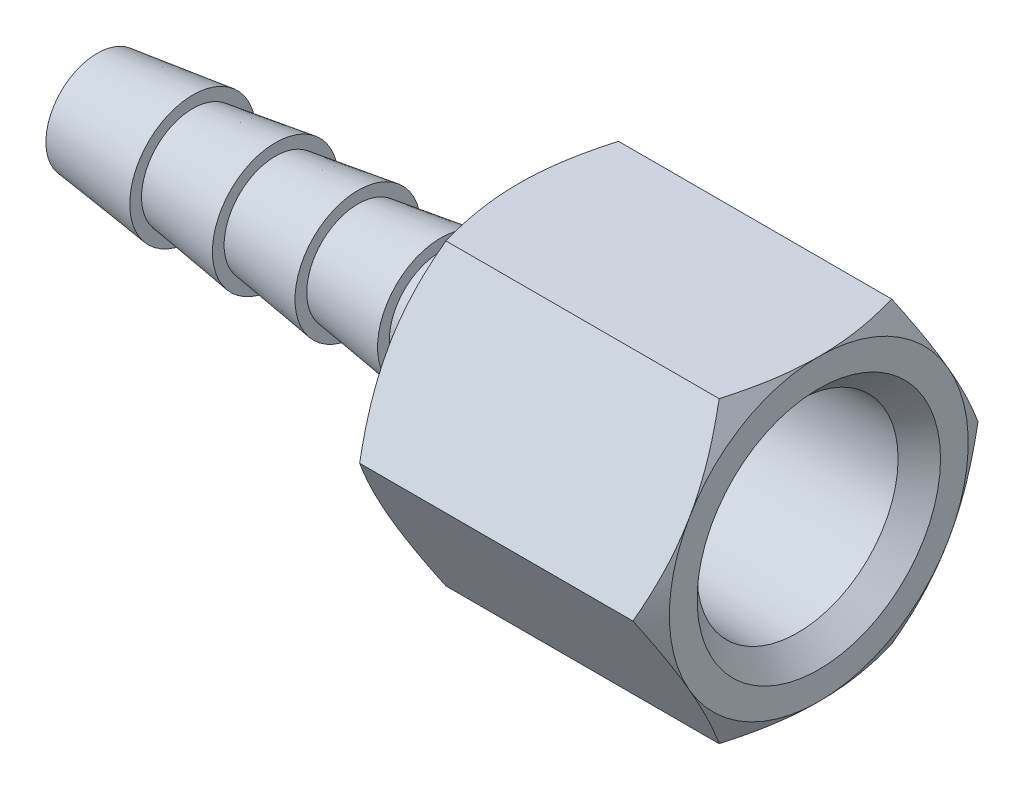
ISO-10303-21;
HEADER;
FILE_DESCRIPTION(('STEP AP214'),'2;1');
FILE_NAME('part.step','',(''),(''),'','','');
FILE_SCHEMA(('AUTOMOTIVE_DESIGN { 1 0 10303 214 1 1 1 1 }'));
ENDSEC;
DATA;
#1=APPLICATION_CONTEXT('core data for automotive mechanical design processes');
#2=APPLICATION_PROTOCOL_DEFINITION('international standard','automotive_design',2000,#1);
#3=PRODUCT_CONTEXT('',#1,'mechanical');
#4=PRODUCT('Part','Part','',(#3));
#5=PRODUCT_RELATED_PRODUCT_CATEGORY('part','',(#4));
#6=PRODUCT_DEFINITION_FORMATION('','',#4);
#7=PRODUCT_DEFINITION_CONTEXT('part definition',#1,'design');
#8=PRODUCT_DEFINITION('design','',#6,#7);
#9=PRODUCT_DEFINITION_SHAPE('','',#8);
#10=(LENGTH_UNIT() NAMED_UNIT(*) SI_UNIT(.MILLI.,.METRE.));
#11=(NAMED_UNIT(*) PLANE_ANGLE_UNIT() SI_UNIT($,.RADIAN.));
#12=(NAMED_UNIT(*) SI_UNIT($,.STERADIAN.) SOLID_ANGLE_UNIT());
#13=UNCERTAINTY_MEASURE_WITH_UNIT(LENGTH_MEASURE(1.E-05),#10,'distance_accuracy_value','');
#14=(GEOMETRIC_REPRESENTATION_CONTEXT(3) GLOBAL_UNCERTAINTY_ASSIGNED_CONTEXT((#13)) GLOBAL_UNIT_ASSIGNED_CONTEXT((#10,
#11,#12)) REPRESENTATION_CONTEXT('',''));
#15=CARTESIAN_POINT('',(0.,0.,0.));
#16=DIRECTION('',(0.,0.,1.));
#17=DIRECTION('',(1.,0.,0.));
#18=AXIS2_PLACEMENT_3D('',#15,#16,#17);
#19=CARTESIAN_POINT('',(0.,0.,1.4986));
#20=DIRECTION('',(-1.,0.,0.));
#21=DIRECTION('',(0.,0.,1.));
#22=AXIS2_PLACEMENT_3D('',#19,#20,#21);
#23=PLANE('',#22);
#24=CARTESIAN_POINT('',(0.,0.,0.));
#25=DIRECTION('',(1.,0.,0.));
#26=DIRECTION('',(0.,0.,-1.));
#27=AXIS2_PLACEMENT_3D('',#24,#25,#26);
#28=CIRCLE('',#27,2.3749);
#29=CARTESIAN_POINT('',(0.,0.,-2.3749));
#30=VERTEX_POINT('',#29);
#31=EDGE_CURVE('E20',#30,#30,#28,.T.);
#32=ORIENTED_EDGE('',*,*,#31,.T.);
#33=EDGE_LOOP('',(#32));
#34=FACE_BOUND('',#33,.T.);
#35=CARTESIAN_POINT('',(-5.6843418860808E-11,0.,0.));
#36=DIRECTION('',(1.,0.,0.));
#37=DIRECTION('',(0.,0.,-1.));
#38=AXIS2_PLACEMENT_3D('',#35,#36,#37);
#39=CIRCLE('',#38,2.99720000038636);
#40=CARTESIAN_POINT('',(-5.6843418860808E-11,0.,-2.99720000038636));
#41=VERTEX_POINT('',#40);
#42=EDGE_CURVE('E369',#41,#41,#39,.T.);
#43=ORIENTED_EDGE('',*,*,#42,.F.);
#44=EDGE_LOOP('',(#43));
#45=FACE_BOUND('',#44,.T.);
#46=ADVANCED_FACE('F16',(#34,#45),#23,.T.);
#47=CARTESIAN_POINT('',(0.,0.,0.));
#48=DIRECTION('',(1.,0.,0.));
#49=DIRECTION('',(0.,0.,-1.));
#50=AXIS2_PLACEMENT_3D('',#47,#48,#49);
#51=CYLINDRICAL_SURFACE('',#50,2.3749);
#52=ORIENTED_EDGE('',*,*,#31,.F.);
#53=EDGE_LOOP('',(#52));
#54=FACE_BOUND('',#53,.T.);
#55=CARTESIAN_POINT('',(26.002506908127,0.,0.));
#56=DIRECTION('',(1.,0.,0.));
#57=DIRECTION('',(0.,1.,0.));
#58=AXIS2_PLACEMENT_3D('',#55,#56,#57);
#59=CIRCLE('',#58,2.3749);
#60=CARTESIAN_POINT('',(26.0025069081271,2.37489999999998,0.));
#61=VERTEX_POINT('',#60);
#62=EDGE_CURVE('E365',#61,#61,#59,.T.);
#63=ORIENTED_EDGE('',*,*,#62,.T.);
#64=EDGE_LOOP('',(#63));
#65=FACE_BOUND('',#64,.T.);
#66=ADVANCED_FACE('F448',(#54,#65),#51,.F.);
#67=CARTESIAN_POINT('',(5.58799999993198,0.,0.));
#68=DIRECTION('',(1.,0.,0.));
#69=DIRECTION('',(0.,0.,-1.));
#70=AXIS2_PLACEMENT_3D('',#67,#68,#69);
#71=CONICAL_SURFACE('',#70,3.68299999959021,0.122116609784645);
#72=ORIENTED_EDGE('',*,*,#42,.T.);
#73=EDGE_LOOP('',(#72));
#74=FACE_BOUND('',#73,.T.);
#75=CARTESIAN_POINT('',(5.58800000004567,0.,0.));
#76=DIRECTION('',(1.,0.,0.));
#77=DIRECTION('',(0.,0.,-1.));
#78=AXIS2_PLACEMENT_3D('',#75,#76,#77);
#79=CIRCLE('',#78,3.68299999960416);
#80=CARTESIAN_POINT('',(5.58800000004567,0.,-3.68299999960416));
#81=VERTEX_POINT('',#80);
#82=EDGE_CURVE('E368',#81,#81,#79,.T.);
#83=ORIENTED_EDGE('',*,*,#82,.F.);
#84=EDGE_LOOP('',(#83));
#85=FACE_BOUND('',#84,.T.);
#86=ADVANCED_FACE('F445',(#74,#85),#71,.T.);
#87=CARTESIAN_POINT('',(27.94,0.,0.));
#88=DIRECTION('',(1.,0.,0.));
#89=DIRECTION('',(0.,1.,0.));
#90=AXIS2_PLACEMENT_3D('',#87,#88,#89);
#91=CONICAL_SURFACE('',#90,5.59943,1.02974425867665);
#92=CARTESIAN_POINT('',(27.94,0.,0.));
#93=DIRECTION('',(1.,0.,0.));
#94=DIRECTION('',(0.,0.,-1.));
#95=AXIS2_PLACEMENT_3D('',#92,#93,#94);
#96=CIRCLE('',#95,5.59943);
#97=CARTESIAN_POINT('',(27.94,0.,-5.59943000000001));
#98=VERTEX_POINT('',#97);
#99=EDGE_CURVE('E370',#98,#98,#96,.T.);
#100=ORIENTED_EDGE('',*,*,#99,.T.);
#101=EDGE_LOOP('',(#100));
#102=FACE_BOUND('',#101,.T.);
#103=ORIENTED_EDGE('',*,*,#62,.F.);
#104=EDGE_LOOP('',(#103));
#105=FACE_BOUND('',#104,.T.);
#106=ADVANCED_FACE('F443',(#102,#105),#91,.F.);
#107=CARTESIAN_POINT('',(5.588,0.,1.8415));
#108=DIRECTION('',(1.,0.,0.));
#109=DIRECTION('',(0.,0.,-1.));
#110=AXIS2_PLACEMENT_3D('',#107,#108,#109);
#111=PLANE('',#110);
#112=CARTESIAN_POINT('',(5.58799999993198,0.,0.));
#113=DIRECTION('',(1.,0.,0.));
#114=DIRECTION('',(0.,0.,-1.));
#115=AXIS2_PLACEMENT_3D('',#112,#113,#114);
#116=CIRCLE('',#115,2.99720000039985);
#117=CARTESIAN_POINT('',(5.58799999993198,0.,-2.99720000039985));
#118=VERTEX_POINT('',#117);
#119=EDGE_CURVE('E373',#118,#118,#116,.T.);
#120=ORIENTED_EDGE('',*,*,#119,.F.);
#121=EDGE_LOOP('',(#120));
#122=FACE_BOUND('',#121,.T.);
#123=ORIENTED_EDGE('',*,*,#82,.T.);
#124=EDGE_LOOP('',(#123));
#125=FACE_BOUND('',#124,.T.);
#126=ADVANCED_FACE('F440',(#122,#125),#111,.T.);
#127=CARTESIAN_POINT('',(32.1437,0.,0.));
#128=DIRECTION('',(-1.,0.,0.));
#129=DIRECTION('',(0.,0.,1.));
#130=AXIS2_PLACEMENT_3D('',#127,#128,#129);
#131=CYLINDRICAL_SURFACE('',#130,5.59943);
#132=CARTESIAN_POINT('',(32.143700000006,0.,0.));
#133=DIRECTION('',(1.,0.,0.));
#134=DIRECTION('',(0.,1.,0.));
#135=AXIS2_PLACEMENT_3D('',#132,#133,#134);
#136=CIRCLE('',#135,5.59943000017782);
#137=CARTESIAN_POINT('',(32.143700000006,5.59943000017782,0.));
#138=VERTEX_POINT('',#137);
#139=EDGE_CURVE('E374',#138,#138,#136,.T.);
#140=ORIENTED_EDGE('',*,*,#139,.T.);
#141=EDGE_LOOP('',(#140));
#142=FACE_BOUND('',#141,.T.);
#143=ORIENTED_EDGE('',*,*,#99,.F.);
#144=EDGE_LOOP('',(#143));
#145=FACE_BOUND('',#144,.T.);
#146=ADVANCED_FACE('F18',(#142,#145),#131,.F.);
#147=CARTESIAN_POINT('',(10.4140000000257,0.,0.));
#148=DIRECTION('',(1.,0.,0.));
#149=DIRECTION('',(0.,0.,-1.));
#150=AXIS2_PLACEMENT_3D('',#147,#148,#149);
#151=CONICAL_SURFACE('',#150,3.68299999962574,0.141160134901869);
#152=ORIENTED_EDGE('',*,*,#119,.T.);
#153=EDGE_LOOP('',(#152));
#154=FACE_BOUND('',#153,.T.);
#155=CARTESIAN_POINT('',(10.4140000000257,0.,0.));
#156=DIRECTION('',(1.,0.,0.));
#157=DIRECTION('',(0.,0.,-1.));
#158=AXIS2_PLACEMENT_3D('',#155,#156,#157);
#159=CIRCLE('',#158,3.68299999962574);
#160=CARTESIAN_POINT('',(10.4140000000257,0.,-3.68299999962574));
#161=VERTEX_POINT('',#160);
#162=EDGE_CURVE('E377',#161,#161,#159,.T.);
#163=ORIENTED_EDGE('',*,*,#162,.F.);
#164=EDGE_LOOP('',(#163));
#165=FACE_BOUND('',#164,.T.);
#166=ADVANCED_FACE('F435',(#154,#165),#151,.T.);
#167=CARTESIAN_POINT('',(40.924778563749,0.,0.));
#168=DIRECTION('',(1.,0.,0.));
#169=DIRECTION('',(0.,0.,-1.));
#170=AXIS2_PLACEMENT_3D('',#167,#168,#169);
#171=CONICAL_SURFACE('',#170,5.87277856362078,0.03111922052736);
#172=CARTESIAN_POINT('',(40.9247785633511,0.,0.));
#173=DIRECTION('',(1.,0.,0.));
#174=DIRECTION('',(0.,1.,0.));
#175=AXIS2_PLACEMENT_3D('',#172,#173,#174);
#176=CIRCLE('',#175,5.87277856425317);
#177=CARTESIAN_POINT('',(40.9247785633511,5.87277856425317,0.));
#178=VERTEX_POINT('',#177);
#179=EDGE_CURVE('E378',#178,#178,#176,.T.);
#180=ORIENTED_EDGE('',*,*,#179,.T.);
#181=EDGE_LOOP('',(#180));
#182=FACE_BOUND('',#181,.T.);
#183=ORIENTED_EDGE('',*,*,#139,.F.);
#184=EDGE_LOOP('',(#183));
#185=FACE_BOUND('',#184,.T.);
#186=ADVANCED_FACE('F431',(#182,#185),#171,.F.);
#187=CARTESIAN_POINT('',(10.414,0.,1.8415));
#188=DIRECTION('',(1.,0.,0.));
#189=DIRECTION('',(0.,0.,-1.));
#190=AXIS2_PLACEMENT_3D('',#187,#188,#189);
#191=PLANE('',#190);
#192=CARTESIAN_POINT('',(10.4139999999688,0.,0.));
#193=DIRECTION('',(1.,0.,0.));
#194=DIRECTION('',(0.,0.,-1.));
#195=AXIS2_PLACEMENT_3D('',#192,#193,#194);
#196=CIRCLE('',#195,2.99720000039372);
#197=CARTESIAN_POINT('',(10.4139999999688,0.,-2.99720000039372));
#198=VERTEX_POINT('',#197);
#199=EDGE_CURVE('E381',#198,#198,#196,.T.);
#200=ORIENTED_EDGE('',*,*,#199,.F.);
#201=EDGE_LOOP('',(#200));
#202=FACE_BOUND('',#201,.T.);
#203=ORIENTED_EDGE('',*,*,#162,.T.);
#204=EDGE_LOOP('',(#203));
#205=FACE_BOUND('',#204,.T.);
#206=ADVANCED_FACE('F427',(#202,#205),#191,.T.);
#207=CARTESIAN_POINT('',(42.1640000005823,0.,0.));
#208=DIRECTION('',(1.,0.,0.));
#209=DIRECTION('',(0.,0.,-1.));
#210=AXIS2_PLACEMENT_3D('',#207,#208,#209);
#211=CONICAL_SURFACE('',#210,7.11199999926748,0.785398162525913);
#212=CARTESIAN_POINT('',(42.164000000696,0.,0.));
#213=DIRECTION('',(1.,0.,0.));
#214=DIRECTION('',(0.,0.,-1.));
#215=AXIS2_PLACEMENT_3D('',#212,#213,#214);
#216=CIRCLE('',#215,7.11199999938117);
#217=CARTESIAN_POINT('',(42.164000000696,0.,-7.11199999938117));
#218=VERTEX_POINT('',#217);
#219=EDGE_CURVE('E738',#218,#218,#216,.F.);
#220=ORIENTED_EDGE('',*,*,#219,.F.);
#221=EDGE_LOOP('',(#220));
#222=FACE_BOUND('',#221,.T.);
#223=ORIENTED_EDGE('',*,*,#179,.F.);
#224=EDGE_LOOP('',(#223));
#225=FACE_BOUND('',#224,.T.);
#226=ADVANCED_FACE('F423',(#222,#225),#211,.F.);
#227=CARTESIAN_POINT('',(15.2400000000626,0.,0.));
#228=DIRECTION('',(1.,0.,0.));
#229=DIRECTION('',(0.,0.,-1.));
#230=AXIS2_PLACEMENT_3D('',#227,#228,#229);
#231=CONICAL_SURFACE('',#230,3.68299999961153,0.141160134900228);
#232=ORIENTED_EDGE('',*,*,#199,.T.);
#233=EDGE_LOOP('',(#232));
#234=FACE_BOUND('',#233,.T.);
#235=CARTESIAN_POINT('',(15.2400000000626,0.,0.));
#236=DIRECTION('',(1.,0.,0.));
#237=DIRECTION('',(0.,0.,-1.));
#238=AXIS2_PLACEMENT_3D('',#235,#236,#237);
#239=CIRCLE('',#238,3.68299999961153);
#240=CARTESIAN_POINT('',(15.2400000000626,0.,-3.68299999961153));
#241=VERTEX_POINT('',#240);
#242=EDGE_CURVE('E119',#241,#241,#239,.T.);
#243=ORIENTED_EDGE('',*,*,#242,.F.);
#244=EDGE_LOOP('',(#243));
#245=FACE_BOUND('',#244,.T.);
#246=ADVANCED_FACE('F419',(#234,#245),#231,.T.);
#247=CARTESIAN_POINT('',(42.164,0.,0.));
#248=DIRECTION('',(1.,0.,0.));
#249=DIRECTION('',(0.,0.,-1.));
#250=AXIS2_PLACEMENT_3D('',#247,#248,#249);
#251=PLANE('',#250);
#252=ORIENTED_EDGE('',*,*,#219,.T.);
#253=EDGE_LOOP('',(#252));
#254=FACE_BOUND('',#253,.T.);
#255=CARTESIAN_POINT('',(42.1640000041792,0.,0.));
#256=DIRECTION('',(-1.,0.,0.));
#257=DIRECTION('',(0.,0.,1.));
#258=AXIS2_PLACEMENT_3D('',#255,#256,#257);
#259=CIRCLE('',#258,8.73125000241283);
#260=CARTESIAN_POINT('',(42.1640000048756,4.36562500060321,-7.56148430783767));
#261=VERTEX_POINT('',#260);
#262=CARTESIAN_POINT('',(42.1640000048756,-4.36562500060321,-7.56148430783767));
#263=VERTEX_POINT('',#262);
#264=EDGE_CURVE('E110',#261,#263,#259,.T.);
#265=ORIENTED_EDGE('',*,*,#264,.F.);
#266=CARTESIAN_POINT('',(42.1640000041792,0.,0.));
#267=DIRECTION('',(-1.,0.,0.));
#268=DIRECTION('',(0.,0.,1.));
#269=AXIS2_PLACEMENT_3D('',#266,#267,#268);
#270=CIRCLE('',#269,8.73125000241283);
#271=CARTESIAN_POINT('',(42.1640000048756,8.73125000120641,0.));
#272=VERTEX_POINT('',#271);
#273=EDGE_CURVE('E104',#272,#261,#270,.T.);
#274=ORIENTED_EDGE('',*,*,#273,.F.);
#275=CARTESIAN_POINT('',(42.1640000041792,0.,0.));
#276=DIRECTION('',(-1.,0.,0.));
#277=DIRECTION('',(0.,0.,1.));
#278=AXIS2_PLACEMENT_3D('',#275,#276,#277);
#279=CIRCLE('',#278,8.73125000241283);
#280=CARTESIAN_POINT('',(42.1640000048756,4.36562500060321,7.56148430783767));
#281=VERTEX_POINT('',#280);
#282=EDGE_CURVE('E731',#281,#272,#279,.T.);
#283=ORIENTED_EDGE('',*,*,#282,.F.);
#284=CARTESIAN_POINT('',(42.1640000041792,0.,0.));
#285=DIRECTION('',(-1.,0.,0.));
#286=DIRECTION('',(0.,0.,1.));
#287=AXIS2_PLACEMENT_3D('',#284,#285,#286);
#288=CIRCLE('',#287,8.73125000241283);
#289=CARTESIAN_POINT('',(42.1640000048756,-4.36562500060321,7.56148430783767));
#290=VERTEX_POINT('',#289);
#291=EDGE_CURVE('E131',#290,#281,#288,.T.);
#292=ORIENTED_EDGE('',*,*,#291,.F.);
#293=CARTESIAN_POINT('',(42.1640000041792,0.,0.));
#294=DIRECTION('',(-1.,0.,0.));
#295=DIRECTION('',(0.,0.,1.));
#296=AXIS2_PLACEMENT_3D('',#293,#294,#295);
#297=CIRCLE('',#296,8.73125000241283);
#298=CARTESIAN_POINT('',(42.1640000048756,-8.73125000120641,0.));
#299=VERTEX_POINT('',#298);
#300=EDGE_CURVE('E125',#299,#290,#297,.T.);
#301=ORIENTED_EDGE('',*,*,#300,.F.);
#302=CARTESIAN_POINT('',(42.1640000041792,0.,0.));
#303=DIRECTION('',(-1.,0.,0.));
#304=DIRECTION('',(0.,0.,1.));
#305=AXIS2_PLACEMENT_3D('',#302,#303,#304);
#306=CIRCLE('',#305,8.73125000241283);
#307=EDGE_CURVE('E122',#263,#299,#306,.T.);
#308=ORIENTED_EDGE('',*,*,#307,.F.);
#309=EDGE_LOOP('',(#265,#274,#283,#292,#301,#308));
#310=FACE_BOUND('',#309,.T.);
#311=ADVANCED_FACE('F123',(#254,#310),#251,.T.);
#312=CARTESIAN_POINT('',(15.24,0.,1.8415));
#313=DIRECTION('',(1.,0.,0.));
#314=DIRECTION('',(0.,0.,-1.));
#315=AXIS2_PLACEMENT_3D('',#312,#313,#314);
#316=PLANE('',#315);
#317=CARTESIAN_POINT('',(15.2399999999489,0.,0.));
#318=DIRECTION('',(1.,0.,0.));
#319=DIRECTION('',(0.,0.,-1.));
#320=AXIS2_PLACEMENT_3D('',#317,#318,#319);
#321=CIRCLE('',#320,2.99720000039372);
#322=CARTESIAN_POINT('',(15.2399999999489,0.,-2.99720000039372));
#323=VERTEX_POINT('',#322);
#324=EDGE_CURVE('E143',#323,#323,#321,.T.);
#325=ORIENTED_EDGE('',*,*,#324,.F.);
#326=EDGE_LOOP('',(#325));
#327=FACE_BOUND('',#326,.T.);
#328=ORIENTED_EDGE('',*,*,#242,.T.);
#329=EDGE_LOOP('',(#328));
#330=FACE_BOUND('',#329,.T.);
#331=ADVANCED_FACE('F411',(#327,#330),#316,.T.);
#332=CARTESIAN_POINT('',(41.3794771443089,0.,0.));
#333=DIRECTION('',(-1.,0.,0.));
#334=DIRECTION('',(0.,0.,1.));
#335=AXIS2_PLACEMENT_3D('',#332,#333,#334);
#336=CONICAL_SURFACE('',#335,10.0900834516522,1.04719755);
#337=CARTESIAN_POINT('',(42.1640000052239,4.3656249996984,-7.56148430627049));
#338=CARTESIAN_POINT('',(42.1640356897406,4.18032870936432,-7.66846516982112));
#339=CARTESIAN_POINT('',(42.1594601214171,3.99504134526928,-7.77544087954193));
#340=CARTESIAN_POINT('',(42.1413517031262,3.62483043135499,-7.98918225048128));
#341=CARTESIAN_POINT('',(42.1278206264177,3.43990681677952,-8.0959479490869));
#342=CARTESIAN_POINT('',(42.0921555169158,3.07161786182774,-8.30857967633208));
#343=CARTESIAN_POINT('',(42.0700647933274,2.88824935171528,-8.41444753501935));
#344=CARTESIAN_POINT('',(42.0177555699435,2.52238596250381,-8.62567886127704));
#345=CARTESIAN_POINT('',(41.9875368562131,2.33989110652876,-8.73104231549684));
#346=CARTESIAN_POINT('',(41.8856222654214,1.79447347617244,-9.04593933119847));
#347=CARTESIAN_POINT('',(41.8026184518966,1.43313516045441,-9.25455810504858));
#348=CARTESIAN_POINT('',(41.6111904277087,0.713565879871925,-9.67000162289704));
#349=CARTESIAN_POINT('',(41.5026392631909,0.355360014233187,-9.87681187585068));
#350=CARTESIAN_POINT('',(41.3841562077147,-6.93152588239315E-10,-10.081979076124));
#351=B_SPLINE_CURVE_WITH_KNOTS('',3,(#337,#338,#339,#340,#341,#342,#343,#344,#345,#346,#347,
#348,#349,#350),.UNSPECIFIED.,.F.,.F.,(4,2,2,2,2,2,4),(0.,0.641819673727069,1.28351230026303,
1.92199968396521,2.56050387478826,3.83583875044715,5.11765026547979),.UNSPECIFIED.);
#352=CARTESIAN_POINT('',(41.3841562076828,0.,-10.0819790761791));
#353=VERTEX_POINT('',#352);
#354=EDGE_CURVE('E116',#261,#353,#351,.T.);
#355=ORIENTED_EDGE('',*,*,#354,.F.);
#356=ORIENTED_EDGE('',*,*,#264,.T.);
#357=CARTESIAN_POINT('',(41.3841562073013,1.00890692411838E-09,-10.0819790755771));
#358=CARTESIAN_POINT('',(41.5026392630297,-0.355360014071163,-9.87681187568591));
#359=CARTESIAN_POINT('',(41.6111904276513,-0.713565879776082,-9.67000162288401));
#360=CARTESIAN_POINT('',(41.8026184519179,-1.43313516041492,-9.2545581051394));
#361=CARTESIAN_POINT('',(41.8856222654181,-1.79447347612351,-9.04593933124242));
#362=CARTESIAN_POINT('',(41.9875368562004,-2.33989110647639,-8.7310423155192));
#363=CARTESIAN_POINT('',(42.0177555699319,-2.52238596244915,-8.62567886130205));
#364=CARTESIAN_POINT('',(42.0700647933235,-2.88824935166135,-8.41444753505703));
#365=CARTESIAN_POINT('',(42.0921555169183,-3.07161786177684,-8.30857967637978));
#366=CARTESIAN_POINT('',(42.1278206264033,-3.43990681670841,-8.09594794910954));
#367=CARTESIAN_POINT('',(42.1413517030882,-3.6248304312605,-7.98918225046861));
#368=CARTESIAN_POINT('',(42.1594601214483,-3.99504134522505,-7.77544087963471));
#369=CARTESIAN_POINT('',(42.1640356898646,-4.18032870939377,-7.6684651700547));
#370=CARTESIAN_POINT('',(42.1640000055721,-4.36562499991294,-7.56148430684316));
#371=B_SPLINE_CURVE_WITH_KNOTS('',3,(#357,#358,#359,#360,#361,#362,#363,#364,#365,#366,#367,
#368,#369,#370),.UNSPECIFIED.,.F.,.F.,(4,2,2,2,2,2,4),(0.,1.28181151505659,2.55714639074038,
3.19565058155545,3.83413796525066,4.47583059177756,5.11765026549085),.UNSPECIFIED.);
#372=EDGE_CURVE('E114',#353,#263,#371,.T.);
#373=ORIENTED_EDGE('',*,*,#372,.F.);
#374=EDGE_LOOP('',(#355,#356,#373));
#375=FACE_BOUND('',#374,.T.);
#376=ADVANCED_FACE('F112',(#375),#336,.T.);
#377=CARTESIAN_POINT('',(41.3794771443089,0.,0.));
#378=DIRECTION('',(-1.,0.,0.));
#379=DIRECTION('',(0.,0.,1.));
#380=AXIS2_PLACEMENT_3D('',#377,#378,#379);
#381=CONICAL_SURFACE('',#380,10.0900834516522,1.04719755);
#382=CARTESIAN_POINT('',(42.1640000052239,8.7312499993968,0.));
#383=CARTESIAN_POINT('',(42.1640356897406,8.73124999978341,-0.213961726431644));
#384=CARTESIAN_POINT('',(42.1594601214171,8.73124999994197,-0.427913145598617));
#385=CARTESIAN_POINT('',(42.1413517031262,8.73125000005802,-0.855395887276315));
#386=CARTESIAN_POINT('',(42.1278206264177,8.73125000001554,-1.06892728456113));
#387=CARTESIAN_POINT('',(42.0921555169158,8.73124999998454,-1.49419073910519));
#388=CARTESIAN_POINT('',(42.0700647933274,8.73124999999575,-1.70592645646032));
#389=CARTESIAN_POINT('',(42.0177555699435,8.73125000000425,-2.12838910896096));
#390=CARTESIAN_POINT('',(41.9875368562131,8.73125000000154,-2.33911601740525));
#391=CARTESIAN_POINT('',(41.8856222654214,8.73124999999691,-2.96891004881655));
#392=CARTESIAN_POINT('',(41.8026184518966,8.73124999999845,-3.3861475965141));
#393=CARTESIAN_POINT('',(41.6111904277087,8.73125000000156,-4.21703463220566));
#394=CARTESIAN_POINT('',(41.5026392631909,8.73125000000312,-4.63065513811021));
#395=CARTESIAN_POINT('',(41.3841562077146,8.73125,-5.04098953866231));
#396=B_SPLINE_CURVE_WITH_KNOTS('',3,(#382,#383,#384,#385,#386,#387,#388,#389,#390,#391,#392,
#393,#394,#395),.UNSPECIFIED.,.F.,.F.,(4,2,2,2,2,2,4),(0.,0.641819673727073,1.28351230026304,
1.92199968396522,2.56050387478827,3.83583875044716,5.11765026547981),.UNSPECIFIED.);
#397=CARTESIAN_POINT('',(41.3841562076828,8.73125000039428,-5.04098953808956));
#398=VERTEX_POINT('',#397);
#399=EDGE_CURVE('E385',#272,#398,#396,.T.);
#400=ORIENTED_EDGE('',*,*,#399,.F.);
#401=ORIENTED_EDGE('',*,*,#273,.T.);
#402=CARTESIAN_POINT('',(41.3841562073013,8.7312500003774,-5.04098953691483));
#403=CARTESIAN_POINT('',(41.5026392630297,8.37588998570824,-5.24615673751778));
#404=CARTESIAN_POINT('',(41.6111904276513,8.01768412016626,-5.45296699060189));
#405=CARTESIAN_POINT('',(41.8026184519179,7.29811483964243,-5.86841050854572));
#406=CARTESIAN_POINT('',(41.8856222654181,6.93677652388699,-6.07702928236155));
#407=CARTESIAN_POINT('',(41.9875368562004,6.39135889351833,-6.39192629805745));
#408=CARTESIAN_POINT('',(42.0177555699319,6.20886403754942,-6.49728975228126));
#409=CARTESIAN_POINT('',(42.0700647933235,5.84300064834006,-6.70852107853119));
#410=CARTESIAN_POINT('',(42.0921555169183,5.65963213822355,-6.81438893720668));
#411=CARTESIAN_POINT('',(42.1278206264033,5.29134318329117,-7.02702066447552));
#412=CARTESIAN_POINT('',(42.1413517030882,5.10641956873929,-7.1337863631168));
#413=CARTESIAN_POINT('',(42.1594601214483,4.73620865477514,-7.34752773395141));
#414=CARTESIAN_POINT('',(42.1640356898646,4.55092129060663,-7.45450344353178));
#415=CARTESIAN_POINT('',(42.1640000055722,4.36562500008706,-7.56148430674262));
#416=B_SPLINE_CURVE_WITH_KNOTS('',3,(#402,#403,#404,#405,#406,#407,#408,#409,#410,#411,#412,
#413,#414,#415),.UNSPECIFIED.,.F.,.F.,(4,2,2,2,2,2,4),(0.,1.28181151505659,2.55714639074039,
3.19565058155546,3.83413796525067,4.47583059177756,5.11765026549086),.UNSPECIFIED.);
#417=EDGE_CURVE('E383',#398,#261,#416,.T.);
#418=ORIENTED_EDGE('',*,*,#417,.F.);
#419=EDGE_LOOP('',(#400,#401,#418));
#420=FACE_BOUND('',#419,.T.);
#421=ADVANCED_FACE('F410',(#420),#381,.T.);
#422=CARTESIAN_POINT('',(41.3794771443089,0.,0.));
#423=DIRECTION('',(-1.,0.,0.));
#424=DIRECTION('',(0.,0.,1.));
#425=AXIS2_PLACEMENT_3D('',#422,#423,#424);
#426=CONICAL_SURFACE('',#425,10.0900834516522,1.04719755);
#427=ORIENTED_EDGE('',*,*,#282,.T.);
#428=CARTESIAN_POINT('',(41.3841562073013,8.73124999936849,5.04098953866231));
#429=CARTESIAN_POINT('',(41.5026392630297,8.73124999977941,4.63065513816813));
#430=CARTESIAN_POINT('',(41.6111904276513,8.73124999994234,4.21703463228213));
#431=CARTESIAN_POINT('',(41.8026184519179,8.73125000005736,3.38614759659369));
#432=CARTESIAN_POINT('',(41.8856222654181,8.73125000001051,2.96891004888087));
#433=CARTESIAN_POINT('',(41.9875368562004,8.73124999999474,2.33911601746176));
#434=CARTESIAN_POINT('',(42.0177555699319,8.73124999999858,2.12838910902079));
#435=CARTESIAN_POINT('',(42.0700647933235,8.73125000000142,1.70592645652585));
#436=CARTESIAN_POINT('',(42.0921555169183,8.73125000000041,1.4941907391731));
#437=CARTESIAN_POINT('',(42.1278206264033,8.73124999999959,1.06892728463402));
#438=CARTESIAN_POINT('',(42.1413517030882,8.7312499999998,0.855395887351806));
#439=CARTESIAN_POINT('',(42.1594601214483,8.7312500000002,0.427913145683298));
#440=CARTESIAN_POINT('',(42.1640356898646,8.73125000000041,0.21396172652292));
#441=CARTESIAN_POINT('',(42.1640000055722,8.73125,1.00535140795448E-10));
#442=B_SPLINE_CURVE_WITH_KNOTS('',3,(#428,#429,#430,#431,#432,#433,#434,#435,#436,#437,#438,
#439,#440,#441),.UNSPECIFIED.,.F.,.F.,(4,2,2,2,2,2,4),(0.,1.28181151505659,2.55714639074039,
3.19565058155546,3.83413796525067,4.47583059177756,5.11765026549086),.UNSPECIFIED.);
#443=CARTESIAN_POINT('',(41.3841562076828,8.73125000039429,5.04098953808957));
#444=VERTEX_POINT('',#443);
#445=EDGE_CURVE('E270',#444,#272,#442,.T.);
#446=ORIENTED_EDGE('',*,*,#445,.F.);
#447=CARTESIAN_POINT('',(42.1640000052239,4.3656249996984,7.5614843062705));
#448=CARTESIAN_POINT('',(42.1640356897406,4.55092129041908,7.45450344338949));
#449=CARTESIAN_POINT('',(42.1594601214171,4.7362086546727,7.34752773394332));
#450=CARTESIAN_POINT('',(42.1413517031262,5.10641956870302,7.13378636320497));
#451=CARTESIAN_POINT('',(42.1278206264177,5.29134318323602,7.02702066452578));
#452=CARTESIAN_POINT('',(42.0921555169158,5.65963213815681,6.8143889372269));
#453=CARTESIAN_POINT('',(42.0700647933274,5.84300064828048,6.70852107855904));
#454=CARTESIAN_POINT('',(42.0177555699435,6.20886403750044,6.49728975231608));
#455=CARTESIAN_POINT('',(41.9875368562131,6.3913588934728,6.3919262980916));
#456=CARTESIAN_POINT('',(41.8856222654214,6.93677652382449,6.07702928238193));
#457=CARTESIAN_POINT('',(41.8026184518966,7.29811483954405,5.86841050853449));
#458=CARTESIAN_POINT('',(41.6111904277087,8.01768412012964,5.4529669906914));
#459=CARTESIAN_POINT('',(41.5026392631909,8.37588998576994,5.24615673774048));
#460=CARTESIAN_POINT('',(41.3841562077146,8.73125000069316,5.04098953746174));
#461=B_SPLINE_CURVE_WITH_KNOTS('',3,(#447,#448,#449,#450,#451,#452,#453,#454,#455,#456,#457,
#458,#459,#460),.UNSPECIFIED.,.F.,.F.,(4,2,2,2,2,2,4),(0.,0.641819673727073,1.28351230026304,
1.92199968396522,2.56050387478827,3.83583875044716,5.11765026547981),.UNSPECIFIED.);
#462=EDGE_CURVE('E388',#281,#444,#461,.T.);
#463=ORIENTED_EDGE('',*,*,#462,.F.);
#464=EDGE_LOOP('',(#427,#446,#463));
#465=FACE_BOUND('',#464,.T.);
#466=ADVANCED_FACE('F571',(#465),#426,.T.);
#467=CARTESIAN_POINT('',(41.3794771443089,0.,0.));
#468=DIRECTION('',(-1.,0.,0.));
#469=DIRECTION('',(0.,0.,1.));
#470=AXIS2_PLACEMENT_3D('',#467,#468,#469);
#471=CONICAL_SURFACE('',#470,10.0900834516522,1.04719755);
#472=ORIENTED_EDGE('',*,*,#291,.T.);
#473=CARTESIAN_POINT('',(41.3841562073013,-1.00890410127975E-09,10.0819790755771));
#474=CARTESIAN_POINT('',(41.5026392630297,0.355360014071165,9.87681187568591));
#475=CARTESIAN_POINT('',(41.6111904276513,0.713565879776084,9.67000162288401));
#476=CARTESIAN_POINT('',(41.8026184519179,1.43313516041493,9.2545581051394));
#477=CARTESIAN_POINT('',(41.8856222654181,1.79447347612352,9.04593933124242));
#478=CARTESIAN_POINT('',(41.9875368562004,2.3398911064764,8.73104231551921));
#479=CARTESIAN_POINT('',(42.0177555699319,2.52238596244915,8.62567886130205));
#480=CARTESIAN_POINT('',(42.0700647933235,2.88824935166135,8.41444753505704));
#481=CARTESIAN_POINT('',(42.0921555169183,3.07161786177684,8.30857967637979));
#482=CARTESIAN_POINT('',(42.1278206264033,3.43990681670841,8.09594794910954));
#483=CARTESIAN_POINT('',(42.1413517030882,3.6248304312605,7.98918225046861));
#484=CARTESIAN_POINT('',(42.1594601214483,3.99504134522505,7.77544087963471));
#485=CARTESIAN_POINT('',(42.1640356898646,4.18032870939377,7.6684651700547));
#486=CARTESIAN_POINT('',(42.1640000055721,4.36562499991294,7.56148430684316));
#487=B_SPLINE_CURVE_WITH_KNOTS('',3,(#473,#474,#475,#476,#477,#478,#479,#480,#481,#482,#483,
#484,#485,#486),.UNSPECIFIED.,.F.,.F.,(4,2,2,2,2,2,4),(0.,1.28181151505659,2.55714639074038,
3.19565058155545,3.83413796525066,4.47583059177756,5.11765026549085),.UNSPECIFIED.);
#488=CARTESIAN_POINT('',(41.3841562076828,0.,10.0819790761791));
#489=VERTEX_POINT('',#488);
#490=EDGE_CURVE('E713',#489,#281,#487,.T.);
#491=ORIENTED_EDGE('',*,*,#490,.F.);
#492=CARTESIAN_POINT('',(42.1640000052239,-4.3656249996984,7.56148430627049));
#493=CARTESIAN_POINT('',(42.1640356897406,-4.18032870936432,7.66846516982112));
#494=CARTESIAN_POINT('',(42.1594601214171,-3.99504134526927,7.77544087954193));
#495=CARTESIAN_POINT('',(42.1413517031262,-3.62483043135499,7.98918225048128));
#496=CARTESIAN_POINT('',(42.1278206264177,-3.43990681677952,8.0959479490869));
#497=CARTESIAN_POINT('',(42.0921555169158,-3.07161786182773,8.30857967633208));
#498=CARTESIAN_POINT('',(42.0700647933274,-2.88824935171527,8.41444753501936));
#499=CARTESIAN_POINT('',(42.0177555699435,-2.5223859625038,8.62567886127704));
#500=CARTESIAN_POINT('',(41.9875368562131,-2.33989110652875,8.73104231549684));
#501=CARTESIAN_POINT('',(41.8856222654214,-1.79447347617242,9.04593933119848));
#502=CARTESIAN_POINT('',(41.8026184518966,-1.4331351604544,9.25455810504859));
#503=CARTESIAN_POINT('',(41.6111904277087,-0.713565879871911,9.67000162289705));
#504=CARTESIAN_POINT('',(41.5026392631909,-0.355360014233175,9.87681187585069));
#505=CARTESIAN_POINT('',(41.3841562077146,6.9315475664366E-10,10.081979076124));
#506=B_SPLINE_CURVE_WITH_KNOTS('',3,(#492,#493,#494,#495,#496,#497,#498,#499,#500,#501,#502,
#503,#504,#505),.UNSPECIFIED.,.F.,.F.,(4,2,2,2,2,2,4),(0.,0.641819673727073,1.28351230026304,
1.92199968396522,2.56050387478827,3.83583875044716,5.11765026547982),.UNSPECIFIED.);
#507=EDGE_CURVE('E184',#290,#489,#506,.T.);
#508=ORIENTED_EDGE('',*,*,#507,.F.);
#509=EDGE_LOOP('',(#472,#491,#508));
#510=FACE_BOUND('',#509,.T.);
#511=ADVANCED_FACE('F166',(#510),#471,.T.);
#512=CARTESIAN_POINT('',(41.3794771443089,0.,0.));
#513=DIRECTION('',(-1.,0.,0.));
#514=DIRECTION('',(0.,0.,1.));
#515=AXIS2_PLACEMENT_3D('',#512,#513,#514);
#516=CONICAL_SURFACE('',#515,10.0900834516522,1.04719755);
#517=CARTESIAN_POINT('',(42.1640000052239,-4.3656249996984,-7.5614843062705));
#518=CARTESIAN_POINT('',(42.1640356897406,-4.55092129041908,-7.45450344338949));
#519=CARTESIAN_POINT('',(42.1594601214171,-4.73620865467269,-7.34752773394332));
#520=CARTESIAN_POINT('',(42.1413517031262,-5.10641956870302,-7.13378636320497));
#521=CARTESIAN_POINT('',(42.1278206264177,-5.29134318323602,-7.02702066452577));
#522=CARTESIAN_POINT('',(42.0921555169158,-5.65963213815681,-6.8143889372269));
#523=CARTESIAN_POINT('',(42.0700647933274,-5.84300064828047,-6.70852107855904));
#524=CARTESIAN_POINT('',(42.0177555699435,-6.20886403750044,-6.49728975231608));
#525=CARTESIAN_POINT('',(41.9875368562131,-6.3913588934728,-6.3919262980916));
#526=CARTESIAN_POINT('',(41.8856222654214,-6.93677652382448,-6.07702928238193));
#527=CARTESIAN_POINT('',(41.8026184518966,-7.29811483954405,-5.86841050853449));
#528=CARTESIAN_POINT('',(41.6111904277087,-8.01768412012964,-5.4529669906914));
#529=CARTESIAN_POINT('',(41.5026392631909,-8.37588998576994,-5.24615673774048));
#530=CARTESIAN_POINT('',(41.3841562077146,-8.73125000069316,-5.04098953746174));
#531=B_SPLINE_CURVE_WITH_KNOTS('',3,(#517,#518,#519,#520,#521,#522,#523,#524,#525,#526,#527,
#528,#529,#530),.UNSPECIFIED.,.F.,.F.,(4,2,2,2,2,2,4),(0.,0.641819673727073,1.28351230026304,
1.92199968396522,2.56050387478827,3.83583875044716,5.11765026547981),.UNSPECIFIED.);
#532=CARTESIAN_POINT('',(41.3841562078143,-8.73125000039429,-5.04098953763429));
#533=VERTEX_POINT('',#532);
#534=EDGE_CURVE('E136',#263,#533,#531,.T.);
#535=ORIENTED_EDGE('',*,*,#534,.F.);
#536=ORIENTED_EDGE('',*,*,#307,.T.);
#537=CARTESIAN_POINT('',(41.3841562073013,-8.73124999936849,-5.04098953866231));
#538=CARTESIAN_POINT('',(41.5026392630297,-8.73124999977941,-4.63065513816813));
#539=CARTESIAN_POINT('',(41.6111904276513,-8.73124999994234,-4.21703463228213));
#540=CARTESIAN_POINT('',(41.8026184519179,-8.73125000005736,-3.38614759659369));
#541=CARTESIAN_POINT('',(41.8856222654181,-8.73125000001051,-2.96891004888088));
#542=CARTESIAN_POINT('',(41.9875368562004,-8.73124999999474,-2.33911601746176));
#543=CARTESIAN_POINT('',(42.0177555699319,-8.73124999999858,-2.1283891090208));
#544=CARTESIAN_POINT('',(42.0700647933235,-8.73125000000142,-1.70592645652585));
#545=CARTESIAN_POINT('',(42.0921555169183,-8.73125000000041,-1.4941907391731));
#546=CARTESIAN_POINT('',(42.1278206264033,-8.73124999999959,-1.06892728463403));
#547=CARTESIAN_POINT('',(42.1413517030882,-8.7312499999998,-0.85539588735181));
#548=CARTESIAN_POINT('',(42.1594601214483,-8.7312500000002,-0.427913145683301));
#549=CARTESIAN_POINT('',(42.1640356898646,-8.73125000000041,-0.213961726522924));
#550=CARTESIAN_POINT('',(42.1640000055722,-8.73125,-1.00539531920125E-10));
#551=B_SPLINE_CURVE_WITH_KNOTS('',3,(#537,#538,#539,#540,#541,#542,#543,#544,#545,#546,#547,
#548,#549,#550),.UNSPECIFIED.,.F.,.F.,(4,2,2,2,2,2,4),(0.,1.28181151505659,2.55714639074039,
3.19565058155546,3.83413796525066,4.47583059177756,5.11765026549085),.UNSPECIFIED.);
#552=EDGE_CURVE('E142',#533,#299,#551,.T.);
#553=ORIENTED_EDGE('',*,*,#552,.F.);
#554=EDGE_LOOP('',(#535,#536,#553));
#555=FACE_BOUND('',#554,.T.);
#556=ADVANCED_FACE('F141',(#555),#516,.T.);
#557=CARTESIAN_POINT('',(41.3794771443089,0.,0.));
#558=DIRECTION('',(-1.,0.,0.));
#559=DIRECTION('',(0.,0.,1.));
#560=AXIS2_PLACEMENT_3D('',#557,#558,#559);
#561=CONICAL_SURFACE('',#560,10.0900834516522,1.04719755);
#562=ORIENTED_EDGE('',*,*,#300,.T.);
#563=CARTESIAN_POINT('',(41.3841562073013,-8.7312500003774,5.04098953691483));
#564=CARTESIAN_POINT('',(41.5026392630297,-8.37588998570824,5.24615673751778));
#565=CARTESIAN_POINT('',(41.6111904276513,-8.01768412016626,5.45296699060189));
#566=CARTESIAN_POINT('',(41.8026184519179,-7.29811483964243,5.86841050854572));
#567=CARTESIAN_POINT('',(41.8856222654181,-6.93677652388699,6.07702928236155));
#568=CARTESIAN_POINT('',(41.9875368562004,-6.39135889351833,6.39192629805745));
#569=CARTESIAN_POINT('',(42.0177555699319,-6.20886403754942,6.49728975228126));
#570=CARTESIAN_POINT('',(42.0700647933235,-5.84300064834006,6.70852107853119));
#571=CARTESIAN_POINT('',(42.0921555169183,-5.65963213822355,6.81438893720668));
#572=CARTESIAN_POINT('',(42.1278206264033,-5.29134318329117,7.02702066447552));
#573=CARTESIAN_POINT('',(42.1413517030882,-5.10641956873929,7.1337863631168));
#574=CARTESIAN_POINT('',(42.1594601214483,-4.73620865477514,7.34752773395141));
#575=CARTESIAN_POINT('',(42.1640356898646,-4.55092129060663,7.45450344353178));
#576=CARTESIAN_POINT('',(42.1640000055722,-4.36562500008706,7.56148430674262));
#577=B_SPLINE_CURVE_WITH_KNOTS('',3,(#563,#564,#565,#566,#567,#568,#569,#570,#571,#572,#573,
#574,#575,#576),.UNSPECIFIED.,.F.,.F.,(4,2,2,2,2,2,4),(0.,1.28181151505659,2.55714639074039,
3.19565058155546,3.83413796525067,4.47583059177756,5.11765026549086),.UNSPECIFIED.);
#578=CARTESIAN_POINT('',(41.3841562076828,-8.73125000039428,5.04098953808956));
#579=VERTEX_POINT('',#578);
#580=EDGE_CURVE('E387',#579,#290,#577,.T.);
#581=ORIENTED_EDGE('',*,*,#580,.F.);
#582=CARTESIAN_POINT('',(42.1640000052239,-8.7312499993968,0.));
#583=CARTESIAN_POINT('',(42.1640356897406,-8.73124999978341,0.21396172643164));
#584=CARTESIAN_POINT('',(42.1594601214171,-8.73124999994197,0.427913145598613));
#585=CARTESIAN_POINT('',(42.1413517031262,-8.73125000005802,0.855395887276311));
#586=CARTESIAN_POINT('',(42.1278206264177,-8.73125000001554,1.06892728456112));
#587=CARTESIAN_POINT('',(42.0921555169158,-8.73124999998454,1.49419073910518));
#588=CARTESIAN_POINT('',(42.0700647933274,-8.73124999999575,1.70592645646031));
#589=CARTESIAN_POINT('',(42.0177555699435,-8.73125000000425,2.12838910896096));
#590=CARTESIAN_POINT('',(41.9875368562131,-8.73125000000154,2.33911601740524));
#591=CARTESIAN_POINT('',(41.8856222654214,-8.73124999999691,2.96891004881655));
#592=CARTESIAN_POINT('',(41.8026184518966,-8.73124999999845,3.3861475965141));
#593=CARTESIAN_POINT('',(41.6111904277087,-8.73125000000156,4.21703463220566));
#594=CARTESIAN_POINT('',(41.5026392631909,-8.73125000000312,4.63065513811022));
#595=CARTESIAN_POINT('',(41.3841562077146,-8.73125,5.04098953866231));
#596=B_SPLINE_CURVE_WITH_KNOTS('',3,(#582,#583,#584,#585,#586,#587,#588,#589,#590,#591,#592,
#593,#594,#595),.UNSPECIFIED.,.F.,.F.,(4,2,2,2,2,2,4),(0.,0.641819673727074,1.28351230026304,
1.92199968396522,2.56050387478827,3.83583875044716,5.11765026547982),.UNSPECIFIED.);
#597=EDGE_CURVE('E178',#299,#579,#596,.T.);
#598=ORIENTED_EDGE('',*,*,#597,.F.);
#599=EDGE_LOOP('',(#562,#581,#598));
#600=FACE_BOUND('',#599,.T.);
#601=ADVANCED_FACE('F165',(#600),#561,.T.);
#602=CARTESIAN_POINT('',(20.0660000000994,0.,0.));
#603=DIRECTION('',(1.,0.,0.));
#604=DIRECTION('',(0.,0.,-1.));
#605=AXIS2_PLACEMENT_3D('',#602,#603,#604);
#606=CONICAL_SURFACE('',#605,3.68299999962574,0.141160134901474);
#607=ORIENTED_EDGE('',*,*,#324,.T.);
#608=EDGE_LOOP('',(#607));
#609=FACE_BOUND('',#608,.T.);
#610=CARTESIAN_POINT('',(20.0660000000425,0.,0.));
#611=DIRECTION('',(1.,0.,0.));
#612=DIRECTION('',(0.,0.,-1.));
#613=AXIS2_PLACEMENT_3D('',#610,#611,#612);
#614=CIRCLE('',#613,3.68299999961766);
#615=CARTESIAN_POINT('',(20.0660000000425,0.,-3.68299999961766));
#616=VERTEX_POINT('',#615);
#617=EDGE_CURVE('E392',#616,#616,#614,.T.);
#618=ORIENTED_EDGE('',*,*,#617,.F.);
#619=EDGE_LOOP('',(#618));
#620=FACE_BOUND('',#619,.T.);
#621=ADVANCED_FACE('F545',(#609,#620),#606,.T.);
#622=CARTESIAN_POINT('',(24.638,0.,-10.0819790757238));
#623=DIRECTION('',(0.,-0.5,-0.866025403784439));
#624=DIRECTION('',(0.,0.866025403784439,-0.5));
#625=AXIS2_PLACEMENT_3D('',#622,#623,#624);
#626=PLANE('',#625);
#627=DIRECTION('',(1.,0.,0.));
#628=VECTOR('',#627,1.);
#629=CARTESIAN_POINT('',(24.638,0.,-10.0819790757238));
#630=LINE('',#629,#628);
#631=CARTESIAN_POINT('',(25.4178437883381,1.11485674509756E-08,-10.0819790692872));
#632=VERTEX_POINT('',#631);
#633=EDGE_CURVE('E139',#353,#632,#630,.F.);
#634=ORIENTED_EDGE('',*,*,#633,.F.);
#635=ORIENTED_EDGE('',*,*,#372,.T.);
#636=ORIENTED_EDGE('',*,*,#534,.T.);
#637=DIRECTION('',(1.,0.,0.));
#638=VECTOR('',#637,1.);
#639=CARTESIAN_POINT('',(24.638,-8.73125,-5.04098953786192));
#640=LINE('',#639,#638);
#641=CARTESIAN_POINT('',(25.417843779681,-8.73124996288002,-5.04098955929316));
#642=VERTEX_POINT('',#641);
#643=EDGE_CURVE('E391',#642,#533,#640,.T.);
#644=ORIENTED_EDGE('',*,*,#643,.F.);
#645=CARTESIAN_POINT('',(24.6379999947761,-4.3656249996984,-7.5614843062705));
#646=CARTESIAN_POINT('',(24.6379643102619,-4.55092128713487,-7.45450344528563));
#647=CARTESIAN_POINT('',(24.642539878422,-4.73620864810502,-7.34752773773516));
#648=CARTESIAN_POINT('',(24.660648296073,-5.1064195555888,-7.13378637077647));
#649=CARTESIAN_POINT('',(24.6741793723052,-5.29134316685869,-7.02702067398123));
#650=CARTESIAN_POINT('',(24.7098444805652,-5.65963211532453,-6.81438895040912));
#651=CARTESIAN_POINT('',(24.7319352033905,-5.84300062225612,-6.70852109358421));
#652=CARTESIAN_POINT('',(24.78424442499,-6.20886400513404,-6.49728977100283));
#653=CARTESIAN_POINT('',(24.814463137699,-6.39135885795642,-6.39192631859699));
#654=CARTESIAN_POINT('',(24.916377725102,-6.93677647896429,-6.07702930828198));
#655=CARTESIAN_POINT('',(24.9993815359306,-7.29811478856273,-5.86841053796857));
#656=CARTESIAN_POINT('',(25.1908095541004,-8.01768405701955,-5.45296702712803));
#657=CARTESIAN_POINT('',(25.29936071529,-8.37588991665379,-5.24615677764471));
#658=CARTESIAN_POINT('',(25.4178437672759,-8.73124992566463,-5.04098958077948));
#659=B_SPLINE_CURVE_WITH_KNOTS('',3,(#645,#646,#647,#648,#649,#650,#651,#652,#653,#654,#655,
#656,#657,#658),.UNSPECIFIED.,.F.,.F.,(4,2,2,2,2,2,4),(0.,0.641819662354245,1.28351227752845,
1.92199965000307,2.56050382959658,3.83583868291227,5.11765017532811),.UNSPECIFIED.);
#660=CARTESIAN_POINT('',(24.6379999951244,-4.36562500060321,-7.56148430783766));
#661=VERTEX_POINT('',#660);
#662=EDGE_CURVE('E219',#661,#642,#659,.T.);
#663=ORIENTED_EDGE('',*,*,#662,.F.);
#664=CARTESIAN_POINT('',(25.417843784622,-2.22971370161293E-08,-10.0819790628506));
#665=CARTESIAN_POINT('',(25.2993607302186,-0.355360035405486,-9.87681186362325));
#666=CARTESIAN_POINT('',(25.190809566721,-0.71356589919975,-9.67000161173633));
#667=CARTESIAN_POINT('',(24.9993815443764,-1.433135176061,-9.2545580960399));
#668=CARTESIAN_POINT('',(24.9163777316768,-1.7944734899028,-9.04593932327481));
#669=CARTESIAN_POINT('',(24.8144631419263,-2.33989111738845,-8.73104230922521));
#670=CARTESIAN_POINT('',(24.7842444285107,-2.52238597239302,-8.62567885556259));
#671=CARTESIAN_POINT('',(24.7319352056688,-2.88824935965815,-8.41444753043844));
#672=CARTESIAN_POINT('',(24.7098444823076,-3.07161786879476,-8.30857967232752));
#673=CARTESIAN_POINT('',(24.6741793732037,-3.43990682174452,-8.09594794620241));
#674=CARTESIAN_POINT('',(24.6606482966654,-3.62483043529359,-7.98918224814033));
#675=CARTESIAN_POINT('',(24.6425398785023,-3.99504134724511,-7.77544087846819));
#676=CARTESIAN_POINT('',(24.6379643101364,-4.18032871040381,-7.66846516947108));
#677=CARTESIAN_POINT('',(24.6379999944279,-4.36562499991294,-7.56148430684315));
#678=B_SPLINE_CURVE_WITH_KNOTS('',3,(#664,#665,#666,#667,#668,#669,#670,#671,#672,#673,#674,
#675,#676,#677),.UNSPECIFIED.,.F.,.F.,(4,2,2,2,2,2,4),(0.,1.28181150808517,2.55714637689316,
3.19565056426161,3.83413794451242,4.4758305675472,5.11765023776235),.UNSPECIFIED.);
#679=EDGE_CURVE('E242',#632,#661,#678,.T.);
#680=ORIENTED_EDGE('',*,*,#679,.F.);
#681=EDGE_LOOP('',(#634,#635,#636,#644,#663,#680));
#682=FACE_BOUND('',#681,.T.);
#683=ADVANCED_FACE('F134',(#682),#626,.T.);
#684=CARTESIAN_POINT('',(24.638,8.73125,-5.04098953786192));
#685=DIRECTION('',(0.,0.5,-0.866025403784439));
#686=DIRECTION('',(0.,0.866025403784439,0.5));
#687=AXIS2_PLACEMENT_3D('',#684,#685,#686);
#688=PLANE('',#687);
#689=DIRECTION('',(1.,0.,0.));
#690=VECTOR('',#689,1.);
#691=CARTESIAN_POINT('',(24.638,8.73125,-5.04098953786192));
#692=LINE('',#691,#690);
#693=CARTESIAN_POINT('',(25.417843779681,8.73125,-5.04098949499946));
#694=VERTEX_POINT('',#693);
#695=EDGE_CURVE('E326',#398,#694,#692,.F.);
#696=ORIENTED_EDGE('',*,*,#695,.F.);
#697=ORIENTED_EDGE('',*,*,#417,.T.);
#698=ORIENTED_EDGE('',*,*,#354,.T.);
#699=ORIENTED_EDGE('',*,*,#633,.T.);
#700=CARTESIAN_POINT('',(24.6379999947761,4.3656249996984,-7.5614843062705));
#701=CARTESIAN_POINT('',(24.6379643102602,4.18032871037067,-7.66846516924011));
#702=CARTESIAN_POINT('',(24.6425398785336,3.99504134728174,-7.77544087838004));
#703=CARTESIAN_POINT('',(24.6606482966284,3.62483043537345,-7.98918224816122));
#704=CARTESIAN_POINT('',(24.6741793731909,3.43990682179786,-8.09594794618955));
#705=CARTESIAN_POINT('',(24.7098444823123,3.07161786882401,-8.30857967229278));
#706=CARTESIAN_POINT('',(24.7319352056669,2.88824935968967,-8.41444753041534));
#707=CARTESIAN_POINT('',(24.784244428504,2.52238597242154,-8.62567885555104));
#708=CARTESIAN_POINT('',(24.8144631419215,2.33989111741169,-8.73104230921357));
#709=CARTESIAN_POINT('',(24.9163777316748,1.79447348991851,-9.04593932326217));
#710=CARTESIAN_POINT('',(24.9993815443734,1.43313517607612,-9.25455809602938));
#711=CARTESIAN_POINT('',(25.1908095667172,0.71356589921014,-9.67000161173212));
#712=CARTESIAN_POINT('',(25.2993607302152,0.355360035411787,-9.87681186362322));
#713=CARTESIAN_POINT('',(25.417843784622,2.2297136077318E-08,-10.0819790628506));
#714=B_SPLINE_CURVE_WITH_KNOTS('',3,(#700,#701,#702,#703,#704,#705,#706,#707,#708,#709,#710,
#711,#712,#713),.UNSPECIFIED.,.F.,.F.,(4,2,2,2,2,2,4),(0.,0.641819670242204,1.28351229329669,
1.92199967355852,2.56050386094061,3.83583872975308,5.11765023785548),.UNSPECIFIED.);
#715=CARTESIAN_POINT('',(24.6379999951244,4.3656250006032,-7.56148430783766));
#716=VERTEX_POINT('',#715);
#717=EDGE_CURVE('E218',#716,#632,#714,.T.);
#718=ORIENTED_EDGE('',*,*,#717,.F.);
#719=CARTESIAN_POINT('',(25.4178438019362,8.73125002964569,-5.04098952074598));
#720=CARTESIAN_POINT('',(25.2993607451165,8.37589001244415,-5.24615672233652));
#721=CARTESIAN_POINT('',(25.1908095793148,8.01768414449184,-5.45296697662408));
#722=CARTESIAN_POINT('',(24.9993815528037,7.29811485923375,-5.86841049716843));
#723=CARTESIAN_POINT('',(24.9163777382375,6.93677654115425,-6.07702927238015));
#724=CARTESIAN_POINT('',(24.814463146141,6.3913589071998,-6.39192629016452));
#725=CARTESIAN_POINT('',(24.7842444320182,6.20886405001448,-6.49728974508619));
#726=CARTESIAN_POINT('',(24.731935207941,5.8430006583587,-6.70852107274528));
#727=CARTESIAN_POINT('',(24.7098444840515,5.65963214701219,-6.81438893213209));
#728=CARTESIAN_POINT('',(24.6741793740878,5.29134318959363,-7.02702066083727));
#729=CARTESIAN_POINT('',(24.6606482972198,5.10641957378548,-7.13378636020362));
#730=CARTESIAN_POINT('',(24.6425398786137,4.73620865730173,-7.34752773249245));
#731=CARTESIAN_POINT('',(24.6379643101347,4.55092129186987,-7.45450344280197));
#732=CARTESIAN_POINT('',(24.6379999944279,4.36562500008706,-7.56148430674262));
#733=B_SPLINE_CURVE_WITH_KNOTS('',3,(#719,#720,#721,#722,#723,#724,#725,#726,#727,#728,#729,
#730,#731,#732),.UNSPECIFIED.,.F.,.F.,(4,2,2,2,2,2,4),(0.,1.28181152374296,2.55714640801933,
3.19565060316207,3.8341379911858,4.47583062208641,5.11765030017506),.UNSPECIFIED.);
#734=EDGE_CURVE('E254',#694,#716,#733,.T.);
#735=ORIENTED_EDGE('',*,*,#734,.F.);
#736=EDGE_LOOP('',(#696,#697,#698,#699,#718,#735));
#737=FACE_BOUND('',#736,.T.);
#738=ADVANCED_FACE('F263',(#737),#688,.T.);
#739=CARTESIAN_POINT('',(24.638,8.73125,5.04098953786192));
#740=DIRECTION('',(0.,1.,0.));
#741=DIRECTION('',(0.,0.,1.));
#742=AXIS2_PLACEMENT_3D('',#739,#740,#741);
#743=PLANE('',#742);
#744=DIRECTION('',(1.,0.,0.));
#745=VECTOR('',#744,1.);
#746=CARTESIAN_POINT('',(24.638,8.73125,5.04098953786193));
#747=LINE('',#746,#745);
#748=CARTESIAN_POINT('',(25.4178437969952,8.73125001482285,5.04098952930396));
#749=VERTEX_POINT('',#748);
#750=EDGE_CURVE('E324',#444,#749,#747,.F.);
#751=ORIENTED_EDGE('',*,*,#750,.F.);
#752=ORIENTED_EDGE('',*,*,#445,.T.);
#753=ORIENTED_EDGE('',*,*,#399,.T.);
#754=ORIENTED_EDGE('',*,*,#695,.T.);
#755=CARTESIAN_POINT('',(24.6379999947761,8.7312499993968,0.));
#756=CARTESIAN_POINT('',(24.6379643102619,8.73124999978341,-0.213961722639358));
#757=CARTESIAN_POINT('',(24.642539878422,8.73124999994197,-0.427913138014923));
#758=CARTESIAN_POINT('',(24.660648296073,8.73125000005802,-0.85539587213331));
#759=CARTESIAN_POINT('',(24.6741793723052,8.73125000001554,-1.06892726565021));
#760=CARTESIAN_POINT('',(24.7098444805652,8.73124999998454,-1.49419071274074));
#761=CARTESIAN_POINT('',(24.7319352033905,8.73124999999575,-1.70592642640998));
#762=CARTESIAN_POINT('',(24.78424442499,8.73125000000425,-2.12838907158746));
#763=CARTESIAN_POINT('',(24.814463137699,8.73125000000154,-2.33911597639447));
#764=CARTESIAN_POINT('',(24.916377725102,8.73124999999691,-2.96890999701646));
#765=CARTESIAN_POINT('',(24.9993815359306,8.73124999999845,-3.38614753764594));
#766=CARTESIAN_POINT('',(25.1908095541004,8.73125000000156,-4.2170345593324));
#767=CARTESIAN_POINT('',(25.29936071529,8.73125000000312,-4.63065505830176));
#768=CARTESIAN_POINT('',(25.4178437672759,8.73125,-5.04098945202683));
#769=B_SPLINE_CURVE_WITH_KNOTS('',3,(#755,#756,#757,#758,#759,#760,#761,#762,#763,#764,#765,
#766,#767,#768),.UNSPECIFIED.,.F.,.F.,(4,2,2,2,2,2,4),(0.,0.641819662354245,1.28351227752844,
1.92199965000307,2.56050382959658,3.83583868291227,5.11765017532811),.UNSPECIFIED.);
#770=CARTESIAN_POINT('',(24.6379999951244,8.73125000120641,0.));
#771=VERTEX_POINT('',#770);
#772=EDGE_CURVE('E247',#771,#694,#769,.T.);
#773=ORIENTED_EDGE('',*,*,#772,.F.);
#774=CARTESIAN_POINT('',(25.4178437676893,8.73124999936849,5.04098945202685));
#775=CARTESIAN_POINT('',(25.2993607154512,8.73124999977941,4.6306550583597));
#776=CARTESIAN_POINT('',(25.1908095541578,8.73124999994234,4.2170345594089));
#777=CARTESIAN_POINT('',(24.9993815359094,8.73125000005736,3.38614753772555));
#778=CARTESIAN_POINT('',(24.9163777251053,8.73125000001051,2.9689099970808));
#779=CARTESIAN_POINT('',(24.8144631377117,8.73124999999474,2.339115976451));
#780=CARTESIAN_POINT('',(24.7842444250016,8.73124999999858,2.1283890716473));
#781=CARTESIAN_POINT('',(24.7319352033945,8.73125000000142,1.70592642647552));
#782=CARTESIAN_POINT('',(24.7098444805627,8.73125000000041,1.49419071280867));
#783=CARTESIAN_POINT('',(24.6741793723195,8.73124999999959,1.06892726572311));
#784=CARTESIAN_POINT('',(24.660648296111,8.7312499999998,0.85539587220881));
#785=CARTESIAN_POINT('',(24.6425398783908,8.7312500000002,0.427913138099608));
#786=CARTESIAN_POINT('',(24.6379643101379,8.73125000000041,0.213961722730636));
#787=CARTESIAN_POINT('',(24.6379999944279,8.73125,1.00534420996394E-10));
#788=B_SPLINE_CURVE_WITH_KNOTS('',3,(#774,#775,#776,#777,#778,#779,#780,#781,#782,#783,#784,
#785,#786,#787),.UNSPECIFIED.,.F.,.F.,(4,2,2,2,2,2,4),(0.,1.28181149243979,2.55714634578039,
3.19565052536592,3.83413789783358,4.47583051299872,5.11765017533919),.UNSPECIFIED.);
#789=EDGE_CURVE('E277',#749,#771,#788,.T.);
#790=ORIENTED_EDGE('',*,*,#789,.F.);
#791=EDGE_LOOP('',(#751,#752,#753,#754,#773,#790));
#792=FACE_BOUND('',#791,.T.);
#793=ADVANCED_FACE('F259',(#792),#743,.T.);
#794=CARTESIAN_POINT('',(24.638,0.,10.0819790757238));
#795=DIRECTION('',(0.,0.5,0.866025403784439));
#796=DIRECTION('',(0.,-0.866025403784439,0.5));
#797=AXIS2_PLACEMENT_3D('',#794,#795,#796);
#798=PLANE('',#797);
#799=CARTESIAN_POINT('',(25.4178437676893,7.40196091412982E-08,10.0819790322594));
#800=CARTESIAN_POINT('',(25.2993607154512,0.355360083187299,9.87681183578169));
#801=CARTESIAN_POINT('',(25.1908095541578,0.713565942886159,9.67000158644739));
#802=CARTESIAN_POINT('',(24.9993815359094,1.43313521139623,9.25455807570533));
#803=CARTESIAN_POINT('',(24.9163777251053,1.7944735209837,9.04593930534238));
#804=CARTESIAN_POINT('',(24.8144631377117,2.33989114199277,8.73104229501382));
#805=CARTESIAN_POINT('',(24.7842444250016,2.52238599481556,8.6256788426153));
#806=CARTESIAN_POINT('',(24.7319352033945,2.8882493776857,8.41444752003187));
#807=CARTESIAN_POINT('',(24.7098444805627,3.07161788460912,8.30857966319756));
#808=CARTESIAN_POINT('',(24.6741793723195,3.43990683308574,8.09594793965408));
#809=CARTESIAN_POINT('',(24.660648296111,3.62483044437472,7.98918224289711));
#810=CARTESIAN_POINT('',(24.6425398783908,3.99504135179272,7.77544087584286));
#811=CARTESIAN_POINT('',(24.6379643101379,4.18032871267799,7.66846516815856));
#812=CARTESIAN_POINT('',(24.6379999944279,4.36562499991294,7.56148430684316));
#813=B_SPLINE_CURVE_WITH_KNOTS('',3,(#799,#800,#801,#802,#803,#804,#805,#806,#807,#808,#809,
#810,#811,#812),.UNSPECIFIED.,.F.,.F.,(4,2,2,2,2,2,4),(0.,1.28181149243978,2.55714634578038,
3.19565052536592,3.83413789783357,4.47583051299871,5.11765017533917),.UNSPECIFIED.);
#814=CARTESIAN_POINT('',(25.4178437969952,1.4822847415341E-08,10.0819790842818));
#815=VERTEX_POINT('',#814);
#816=CARTESIAN_POINT('',(24.6379999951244,4.36562500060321,7.56148430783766));
#817=VERTEX_POINT('',#816);
#818=EDGE_CURVE('E306',#815,#817,#813,.T.);
#819=ORIENTED_EDGE('',*,*,#818,.F.);
#820=DIRECTION('',(1.,0.,0.));
#821=VECTOR('',#820,1.);
#822=CARTESIAN_POINT('',(24.638,0.,10.0819790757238));
#823=LINE('',#822,#821);
#824=EDGE_CURVE('E179',#489,#815,#823,.F.);
#825=ORIENTED_EDGE('',*,*,#824,.F.);
#826=ORIENTED_EDGE('',*,*,#490,.T.);
#827=ORIENTED_EDGE('',*,*,#462,.T.);
#828=ORIENTED_EDGE('',*,*,#750,.T.);
#829=CARTESIAN_POINT('',(24.6379999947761,4.3656249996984,7.5614843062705));
#830=CARTESIAN_POINT('',(24.6379643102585,4.55092129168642,7.45450344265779));
#831=CARTESIAN_POINT('',(24.642539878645,4.73620865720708,7.34752773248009));
#832=CARTESIAN_POINT('',(24.6606482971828,5.10641957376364,7.13378636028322));
#833=CARTESIAN_POINT('',(24.6741793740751,5.29134318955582,7.02702066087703));
#834=CARTESIAN_POINT('',(24.7098444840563,5.65963214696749,6.81438893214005));
#835=CARTESIAN_POINT('',(24.7319352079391,5.84300065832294,6.70852107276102));
#836=CARTESIAN_POINT('',(24.7842444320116,6.20886404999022,6.49728974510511));
#837=CARTESIAN_POINT('',(24.8144631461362,6.39135890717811,6.39192629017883));
#838=CARTESIAN_POINT('',(24.9163777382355,6.93677654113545,6.07702927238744));
#839=CARTESIAN_POINT('',(24.9993815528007,7.29811485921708,5.86841049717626));
#840=CARTESIAN_POINT('',(25.190809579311,8.01768414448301,5.45296697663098));
#841=CARTESIAN_POINT('',(25.2993607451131,8.37589001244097,5.24615672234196));
#842=CARTESIAN_POINT('',(25.4178438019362,8.73125002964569,5.04098952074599));
#843=B_SPLINE_CURVE_WITH_KNOTS('',3,(#829,#830,#831,#832,#833,#834,#835,#836,#837,#838,#839,
#840,#841,#842),.UNSPECIFIED.,.F.,.F.,(4,2,2,2,2,2,4),(0.,0.641819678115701,1.28351230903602,
1.92199969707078,2.56050389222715,3.83583877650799,5.11765030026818),.UNSPECIFIED.);
#844=EDGE_CURVE('E282',#817,#749,#843,.T.);
#845=ORIENTED_EDGE('',*,*,#844,.F.);
#846=EDGE_LOOP('',(#819,#825,#826,#827,#828,#845));
#847=FACE_BOUND('',#846,.T.);
#848=ADVANCED_FACE('F262',(#847),#798,.T.);
#849=CARTESIAN_POINT('',(24.638,-8.73125,5.04098953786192));
#850=DIRECTION('',(0.,-0.5,0.866025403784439));
#851=DIRECTION('',(0.,-0.866025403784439,-0.5));
#852=AXIS2_PLACEMENT_3D('',#849,#850,#851);
#853=PLANE('',#852);
#854=CARTESIAN_POINT('',(25.4178437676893,-8.73124992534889,5.04098958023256));
#855=CARTESIAN_POINT('',(25.2993607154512,-8.37588991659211,5.246156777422));
#856=CARTESIAN_POINT('',(25.1908095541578,-8.01768405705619,5.4529670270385));
#857=CARTESIAN_POINT('',(24.9993815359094,-7.29811478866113,5.86841053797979));
#858=CARTESIAN_POINT('',(24.9163777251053,-6.93677647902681,6.07702930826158));
#859=CARTESIAN_POINT('',(24.8144631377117,-6.39135885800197,6.39192631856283));
#860=CARTESIAN_POINT('',(24.7842444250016,-6.20886400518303,6.497289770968));
#861=CARTESIAN_POINT('',(24.7319352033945,-5.84300062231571,6.70852109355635));
#862=CARTESIAN_POINT('',(24.7098444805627,-5.65963211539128,6.8143889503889));
#863=CARTESIAN_POINT('',(24.6741793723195,-5.29134316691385,7.02702067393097));
#864=CARTESIAN_POINT('',(24.660648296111,-5.10641955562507,7.1337863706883));
#865=CARTESIAN_POINT('',(24.6425398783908,-4.73620864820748,7.34752773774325));
#866=CARTESIAN_POINT('',(24.6379643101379,-4.55092128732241,7.45450344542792));
#867=CARTESIAN_POINT('',(24.6379999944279,-4.36562500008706,7.56148430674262));
#868=B_SPLINE_CURVE_WITH_KNOTS('',3,(#854,#855,#856,#857,#858,#859,#860,#861,#862,#863,#864,
#865,#866,#867),.UNSPECIFIED.,.F.,.F.,(4,2,2,2,2,2,4),(0.,1.28181149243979,2.55714634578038,
3.19565052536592,3.83413789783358,4.47583051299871,5.11765017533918),.UNSPECIFIED.);
#869=CARTESIAN_POINT('',(25.4178437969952,-8.73125,5.04098955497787));
#870=VERTEX_POINT('',#869);
#871=CARTESIAN_POINT('',(24.6379999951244,-4.3656250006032,7.56148430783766));
#872=VERTEX_POINT('',#871);
#873=EDGE_CURVE('E35',#870,#872,#868,.T.);
#874=ORIENTED_EDGE('',*,*,#873,.F.);
#875=DIRECTION('',(1.,0.,0.));
#876=VECTOR('',#875,1.);
#877=CARTESIAN_POINT('',(24.638,-8.73125,5.04098953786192));
#878=LINE('',#877,#876);
#879=EDGE_CURVE('E360',#579,#870,#878,.F.);
#880=ORIENTED_EDGE('',*,*,#879,.F.);
#881=ORIENTED_EDGE('',*,*,#580,.T.);
#882=ORIENTED_EDGE('',*,*,#507,.T.);
#883=ORIENTED_EDGE('',*,*,#824,.T.);
#884=CARTESIAN_POINT('',(24.6379999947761,-4.3656249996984,7.5614843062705));
#885=CARTESIAN_POINT('',(24.6379643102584,-4.18032870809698,7.66846517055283));
#886=CARTESIAN_POINT('',(24.642539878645,-3.99504134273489,7.77544088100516));
#887=CARTESIAN_POINT('',(24.6606482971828,-3.62483042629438,7.98918225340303));
#888=CARTESIAN_POINT('',(24.6741793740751,-3.43990681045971,8.09594795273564));
#889=CARTESIAN_POINT('',(24.7098444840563,-3.07161785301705,8.30857968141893));
#890=CARTESIAN_POINT('',(24.7319352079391,-2.8882493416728,8.41444754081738));
#891=CARTESIAN_POINT('',(24.7842444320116,-2.52238595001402,8.62567886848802));
#892=CARTESIAN_POINT('',(24.8144631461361,-2.33989109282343,8.73104232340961));
#893=CARTESIAN_POINT('',(24.9163777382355,-1.79447345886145,9.04593934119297));
#894=CARTESIAN_POINT('',(24.9993815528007,-1.43313514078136,9.25455811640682));
#895=CARTESIAN_POINT('',(25.190809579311,-0.713565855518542,9.67000163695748));
#896=CARTESIAN_POINT('',(25.2993607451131,-0.355359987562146,9.87681189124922));
#897=CARTESIAN_POINT('',(25.4178438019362,2.96456900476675E-08,10.0819790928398));
#898=B_SPLINE_CURVE_WITH_KNOTS('',3,(#884,#885,#886,#887,#888,#889,#890,#891,#892,#893,#894,
#895,#896,#897),.UNSPECIFIED.,.F.,.F.,(4,2,2,2,2,2,4),(0.,0.641819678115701,1.28351230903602,
1.92199969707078,2.56050389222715,3.835838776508,5.11765030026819),.UNSPECIFIED.);
#899=EDGE_CURVE('E302',#872,#815,#898,.T.);
#900=ORIENTED_EDGE('',*,*,#899,.F.);
#901=EDGE_LOOP('',(#874,#880,#881,#882,#883,#900));
#902=FACE_BOUND('',#901,.T.);
#903=ADVANCED_FACE('F195',(#902),#853,.T.);
#904=CARTESIAN_POINT('',(24.638,-8.73125,-5.04098953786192));
#905=DIRECTION('',(0.,-1.,0.));
#906=DIRECTION('',(0.,0.,-1.));
#907=AXIS2_PLACEMENT_3D('',#904,#905,#906);
#908=PLANE('',#907);
#909=CARTESIAN_POINT('',(25.4178438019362,-8.73125,-5.04098957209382));
#910=CARTESIAN_POINT('',(25.2993607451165,-8.73125,-4.63065516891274));
#911=CARTESIAN_POINT('',(25.1908095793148,-8.73125,-4.21703466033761));
#912=CARTESIAN_POINT('',(24.9993815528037,-8.73125,-3.38614761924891));
#913=CARTESIAN_POINT('',(24.9163777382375,-8.73125,-2.96891006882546));
#914=CARTESIAN_POINT('',(24.814463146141,-8.73125,-2.33911603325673));
#915=CARTESIAN_POINT('',(24.7842444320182,-8.73125,-2.12838912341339));
#916=CARTESIAN_POINT('',(24.731935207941,-8.73125,-1.7059264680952));
#917=CARTESIAN_POINT('',(24.7098444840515,-8.73125,-1.49419074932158));
#918=CARTESIAN_POINT('',(24.6741793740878,-8.73125,-1.06892729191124));
#919=CARTESIAN_POINT('',(24.6606482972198,-8.73125,-0.855395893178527));
#920=CARTESIAN_POINT('',(24.6425398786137,-8.73125,-0.427913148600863));
#921=CARTESIAN_POINT('',(24.6379643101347,-8.73125,-0.213961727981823));
#922=CARTESIAN_POINT('',(24.6379999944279,-8.73125,-1.00533998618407E-10));
#923=B_SPLINE_CURVE_WITH_KNOTS('',3,(#909,#910,#911,#912,#913,#914,#915,#916,#917,#918,#919,
#920,#921,#922),.UNSPECIFIED.,.F.,.F.,(4,2,2,2,2,2,4),(0.,1.28181152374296,2.55714640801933,
3.19565060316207,3.8341379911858,4.47583062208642,5.11765030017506),.UNSPECIFIED.);
#924=CARTESIAN_POINT('',(24.6379999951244,-8.73125000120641,0.));
#925=VERTEX_POINT('',#924);
#926=EDGE_CURVE('E212',#642,#925,#923,.T.);
#927=ORIENTED_EDGE('',*,*,#926,.F.);
#928=ORIENTED_EDGE('',*,*,#643,.T.);
#929=ORIENTED_EDGE('',*,*,#552,.T.);
#930=ORIENTED_EDGE('',*,*,#597,.T.);
#931=ORIENTED_EDGE('',*,*,#879,.T.);
#932=CARTESIAN_POINT('',(24.6379999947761,-8.7312499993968,0.));
#933=CARTESIAN_POINT('',(24.6379643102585,-8.73124999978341,0.213961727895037));
#934=CARTESIAN_POINT('',(24.642539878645,-8.73124999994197,0.427913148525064));
#935=CARTESIAN_POINT('',(24.6606482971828,-8.73125000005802,0.855395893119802));
#936=CARTESIAN_POINT('',(24.6741793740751,-8.73125000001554,1.0689272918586));
#937=CARTESIAN_POINT('',(24.7098444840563,-8.73124999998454,1.49419074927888));
#938=CARTESIAN_POINT('',(24.7319352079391,-8.73124999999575,1.70592646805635));
#939=CARTESIAN_POINT('',(24.7842444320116,-8.73125000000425,2.12838912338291));
#940=CARTESIAN_POINT('',(24.8144631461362,-8.73125000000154,2.33911603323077));
#941=CARTESIAN_POINT('',(24.9163777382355,-8.73124999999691,2.96891006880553));
#942=CARTESIAN_POINT('',(24.9993815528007,-8.73124999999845,3.38614761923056));
#943=CARTESIAN_POINT('',(25.190809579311,-8.73125000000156,4.2170346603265));
#944=CARTESIAN_POINT('',(25.2993607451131,-8.73125000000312,4.63065516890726));
#945=CARTESIAN_POINT('',(25.4178438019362,-8.73125,5.04098957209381));
#946=B_SPLINE_CURVE_WITH_KNOTS('',3,(#932,#933,#934,#935,#936,#937,#938,#939,#940,#941,#942,
#943,#944,#945),.UNSPECIFIED.,.F.,.F.,(4,2,2,2,2,2,4),(0.,0.6418196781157,1.28351230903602,
1.92199969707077,2.56050389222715,3.835838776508,5.11765030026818),.UNSPECIFIED.);
#947=EDGE_CURVE('E204',#925,#870,#946,.T.);
#948=ORIENTED_EDGE('',*,*,#947,.F.);
#949=EDGE_LOOP('',(#927,#928,#929,#930,#931,#948));
#950=FACE_BOUND('',#949,.T.);
#951=ADVANCED_FACE('F190',(#950),#908,.T.);
#952=CARTESIAN_POINT('',(20.066,0.,1.8415));
#953=DIRECTION('',(1.,0.,0.));
#954=DIRECTION('',(0.,0.,-1.));
#955=AXIS2_PLACEMENT_3D('',#952,#953,#954);
#956=PLANE('',#955);
#957=CARTESIAN_POINT('',(20.0659999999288,0.,0.));
#958=DIRECTION('',(1.,0.,0.));
#959=DIRECTION('',(0.,1.,0.));
#960=AXIS2_PLACEMENT_3D('',#957,#958,#959);
#961=CIRCLE('',#960,2.99720000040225);
#962=CARTESIAN_POINT('',(20.0659999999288,2.99720000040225,0.));
#963=VERTEX_POINT('',#962);
#964=EDGE_CURVE('E347',#963,#963,#961,.T.);
#965=ORIENTED_EDGE('',*,*,#964,.F.);
#966=EDGE_LOOP('',(#965));
#967=FACE_BOUND('',#966,.T.);
#968=ORIENTED_EDGE('',*,*,#617,.T.);
#969=EDGE_LOOP('',(#968));
#970=FACE_BOUND('',#969,.T.);
#971=ADVANCED_FACE('F194',(#967,#970),#956,.T.);
#972=CARTESIAN_POINT('',(25.4225228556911,0.,0.));
#973=DIRECTION('',(1.,0.,0.));
#974=DIRECTION('',(0.,0.,-1.));
#975=AXIS2_PLACEMENT_3D('',#972,#973,#974);
#976=CONICAL_SURFACE('',#975,10.0900834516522,1.04719755);
#977=ORIENTED_EDGE('',*,*,#926,.T.);
#978=CARTESIAN_POINT('',(24.6379999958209,0.,0.));
#979=DIRECTION('',(1.,0.,0.));
#980=DIRECTION('',(0.,0.,-1.));
#981=AXIS2_PLACEMENT_3D('',#978,#979,#980);
#982=CIRCLE('',#981,8.73125000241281);
#983=EDGE_CURVE('E342',#925,#661,#982,.T.);
#984=ORIENTED_EDGE('',*,*,#983,.T.);
#985=ORIENTED_EDGE('',*,*,#662,.T.);
#986=EDGE_LOOP('',(#977,#984,#985));
#987=FACE_BOUND('',#986,.T.);
#988=ADVANCED_FACE('F228',(#987),#976,.T.);
#989=CARTESIAN_POINT('',(25.4225228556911,0.,0.));
#990=DIRECTION('',(1.,0.,0.));
#991=DIRECTION('',(0.,0.,-1.));
#992=AXIS2_PLACEMENT_3D('',#989,#990,#991);
#993=CONICAL_SURFACE('',#992,10.0900834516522,1.04719755);
#994=ORIENTED_EDGE('',*,*,#679,.T.);
#995=CARTESIAN_POINT('',(24.6379999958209,0.,0.));
#996=DIRECTION('',(1.,0.,0.));
#997=DIRECTION('',(0.,0.,-1.));
#998=AXIS2_PLACEMENT_3D('',#995,#996,#997);
#999=CIRCLE('',#998,8.73125000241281);
#1000=EDGE_CURVE('E340',#661,#716,#999,.T.);
#1001=ORIENTED_EDGE('',*,*,#1000,.T.);
#1002=ORIENTED_EDGE('',*,*,#717,.T.);
#1003=EDGE_LOOP('',(#994,#1001,#1002));
#1004=FACE_BOUND('',#1003,.T.);
#1005=ADVANCED_FACE('F231',(#1004),#993,.T.);
#1006=CARTESIAN_POINT('',(25.4225228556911,0.,0.));
#1007=DIRECTION('',(1.,0.,0.));
#1008=DIRECTION('',(0.,0.,-1.));
#1009=AXIS2_PLACEMENT_3D('',#1006,#1007,#1008);
#1010=CONICAL_SURFACE('',#1009,10.0900834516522,1.04719755);
#1011=ORIENTED_EDGE('',*,*,#734,.T.);
#1012=CARTESIAN_POINT('',(24.6379999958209,0.,0.));
#1013=DIRECTION('',(1.,0.,0.));
#1014=DIRECTION('',(0.,0.,-1.));
#1015=AXIS2_PLACEMENT_3D('',#1012,#1013,#1014);
#1016=CIRCLE('',#1015,8.73125000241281);
#1017=EDGE_CURVE('E334',#716,#771,#1016,.T.);
#1018=ORIENTED_EDGE('',*,*,#1017,.T.);
#1019=ORIENTED_EDGE('',*,*,#772,.T.);
#1020=EDGE_LOOP('',(#1011,#1018,#1019));
#1021=FACE_BOUND('',#1020,.T.);
#1022=ADVANCED_FACE('F237',(#1021),#1010,.T.);
#1023=CARTESIAN_POINT('',(25.4225228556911,0.,0.));
#1024=DIRECTION('',(1.,0.,0.));
#1025=DIRECTION('',(0.,0.,-1.));
#1026=AXIS2_PLACEMENT_3D('',#1023,#1024,#1025);
#1027=CONICAL_SURFACE('',#1026,10.0900834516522,1.04719755);
#1028=CARTESIAN_POINT('',(24.6379999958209,0.,0.));
#1029=DIRECTION('',(1.,0.,0.));
#1030=DIRECTION('',(0.,0.,-1.));
#1031=AXIS2_PLACEMENT_3D('',#1028,#1029,#1030);
#1032=CIRCLE('',#1031,8.73125000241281);
#1033=EDGE_CURVE('E319',#771,#817,#1032,.T.);
#1034=ORIENTED_EDGE('',*,*,#1033,.T.);
#1035=ORIENTED_EDGE('',*,*,#844,.T.);
#1036=ORIENTED_EDGE('',*,*,#789,.T.);
#1037=EDGE_LOOP('',(#1034,#1035,#1036));
#1038=FACE_BOUND('',#1037,.T.);
#1039=ADVANCED_FACE('F287',(#1038),#1027,.T.);
#1040=CARTESIAN_POINT('',(25.4225228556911,0.,0.));
#1041=DIRECTION('',(1.,0.,0.));
#1042=DIRECTION('',(0.,0.,-1.));
#1043=AXIS2_PLACEMENT_3D('',#1040,#1041,#1042);
#1044=CONICAL_SURFACE('',#1043,10.0900834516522,1.04719755);
#1045=CARTESIAN_POINT('',(24.6379999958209,0.,0.));
#1046=DIRECTION('',(1.,0.,0.));
#1047=DIRECTION('',(0.,0.,-1.));
#1048=AXIS2_PLACEMENT_3D('',#1045,#1046,#1047);
#1049=CIRCLE('',#1048,8.73125000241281);
#1050=EDGE_CURVE('E337',#817,#872,#1049,.T.);
#1051=ORIENTED_EDGE('',*,*,#1050,.T.);
#1052=ORIENTED_EDGE('',*,*,#899,.T.);
#1053=ORIENTED_EDGE('',*,*,#818,.T.);
#1054=EDGE_LOOP('',(#1051,#1052,#1053));
#1055=FACE_BOUND('',#1054,.T.);
#1056=ADVANCED_FACE('F291',(#1055),#1044,.T.);
#1057=CARTESIAN_POINT('',(25.4225228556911,0.,0.));
#1058=DIRECTION('',(1.,0.,0.));
#1059=DIRECTION('',(0.,0.,-1.));
#1060=AXIS2_PLACEMENT_3D('',#1057,#1058,#1059);
#1061=CONICAL_SURFACE('',#1060,10.0900834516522,1.04719755);
#1062=CARTESIAN_POINT('',(24.6379999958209,0.,0.));
#1063=DIRECTION('',(1.,0.,0.));
#1064=DIRECTION('',(0.,0.,-1.));
#1065=AXIS2_PLACEMENT_3D('',#1062,#1063,#1064);
#1066=CIRCLE('',#1065,8.73125000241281);
#1067=EDGE_CURVE('E26',#872,#925,#1066,.T.);
#1068=ORIENTED_EDGE('',*,*,#1067,.T.);
#1069=ORIENTED_EDGE('',*,*,#947,.T.);
#1070=ORIENTED_EDGE('',*,*,#873,.T.);
#1071=EDGE_LOOP('',(#1068,#1069,#1070));
#1072=FACE_BOUND('',#1071,.T.);
#1073=ADVANCED_FACE('F296',(#1072),#1061,.T.);
#1074=CARTESIAN_POINT('',(24.6379999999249,0.,0.));
#1075=DIRECTION('',(1.,0.,0.));
#1076=DIRECTION('',(0.,1.,0.));
#1077=AXIS2_PLACEMENT_3D('',#1074,#1075,#1076);
#1078=CONICAL_SURFACE('',#1077,3.68299999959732,0.148889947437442);
#1079=CARTESIAN_POINT('',(24.6380000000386,0.,0.));
#1080=DIRECTION('',(1.,0.,0.));
#1081=DIRECTION('',(0.,1.,0.));
#1082=AXIS2_PLACEMENT_3D('',#1079,#1080,#1081);
#1083=CIRCLE('',#1082,3.68299999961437);
#1084=CARTESIAN_POINT('',(24.6380000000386,3.68299999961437,0.));
#1085=VERTEX_POINT('',#1084);
#1086=EDGE_CURVE('E11',#1085,#1085,#1083,.F.);
#1087=ORIENTED_EDGE('',*,*,#1086,.T.);
#1088=EDGE_LOOP('',(#1087));
#1089=FACE_BOUND('',#1088,.T.);
#1090=ORIENTED_EDGE('',*,*,#964,.T.);
#1091=EDGE_LOOP('',(#1090));
#1092=FACE_BOUND('',#1091,.T.);
#1093=ADVANCED_FACE('F462',(#1089,#1092),#1078,.T.);
#1094=CARTESIAN_POINT('',(24.638,0.,0.));
#1095=DIRECTION('',(1.,0.,0.));
#1096=DIRECTION('',(0.,0.,-1.));
#1097=AXIS2_PLACEMENT_3D('',#1094,#1095,#1096);
#1098=PLANE('',#1097);
#1099=ORIENTED_EDGE('',*,*,#1086,.F.);
#1100=EDGE_LOOP('',(#1099));
#1101=FACE_BOUND('',#1100,.T.);
#1102=ORIENTED_EDGE('',*,*,#1050,.F.);
#1103=ORIENTED_EDGE('',*,*,#1033,.F.);
#1104=ORIENTED_EDGE('',*,*,#1017,.F.);
#1105=ORIENTED_EDGE('',*,*,#1000,.F.);
#1106=ORIENTED_EDGE('',*,*,#983,.F.);
#1107=ORIENTED_EDGE('',*,*,#1067,.F.);
#1108=EDGE_LOOP('',(#1102,#1103,#1104,#1105,#1106,#1107));
#1109=FACE_BOUND('',#1108,.T.);
#1110=ADVANCED_FACE('F332',(#1101,#1109),#1098,.F.);
#1111=CLOSED_SHELL('',(#46,#66,#86,#106,#126,#146,#166,#186,#206,#226,#246,#311,#331,#376,#421,
#466,#511,#556,#601,#621,#683,#738,#793,#848,#903,#951,#971,#988,#1005,#1022,#1039,#1056,#1073,
#1093,#1110));
#1112=MANIFOLD_SOLID_BREP('B1',#1111);
#1113=ADVANCED_BREP_SHAPE_REPRESENTATION('',(#18,#1112),#14);
#1114=SHAPE_DEFINITION_REPRESENTATION(#9,#1113);
ENDSEC;
END-ISO-10303-21;
